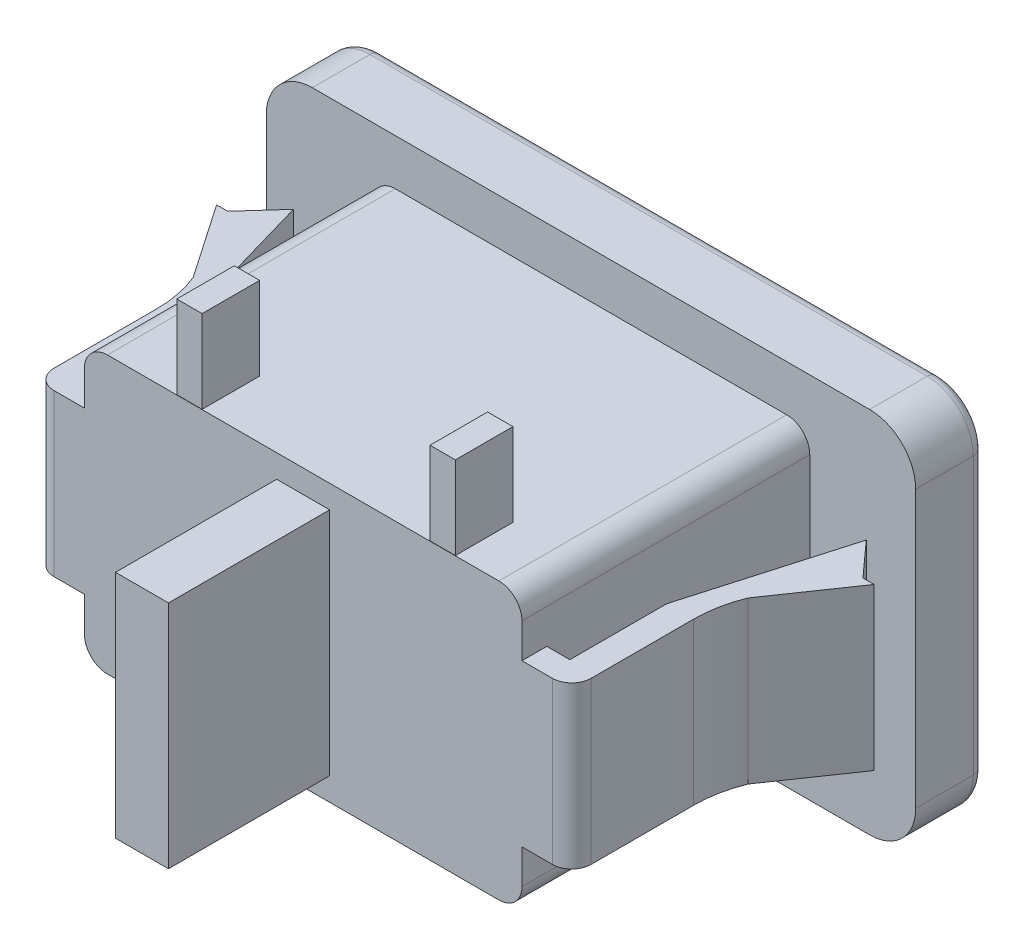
from build123d import *

# Parameters (mm, degrees)
BOSS_EXTRUDE1_DEPTH = 3
BOSS_EXTRUDE3_DEPTH = 12.5
BOSS_EXTRUDE7_DEPTH = 3.5
CUT_EXTRUDE1_DEPTH  = 13.6
SKETCH5_W           = 2.3
SKETCH5_H           = 10
BOSS_EXTRUDE4_DEPTH = 7
SKETCH7_R           = 3.15
BOSS_EXTRUDE6_DEPTH = 3.45
SKETCH6_R           = 1.18
BOSS_EXTRUDE5_DEPTH = 9.1
FILLET3_R           = 1.18
FILLET4_R           = 0.5
SKETCH14_W          = 1.1
SKETCH14_H          = 2.5
BOSS_EXTRUDE8_DEPTH = 3.6


with BuildPart() as part:
    # Sketch1 → Boss-Extrude1 (new body)
    with BuildSketch(Plane.XY):
        with BuildLine():
            Line((-12.1, -8), (12.1, -8))
            ThreePointArc((12.1, -8), (13.514213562, -7.414213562), (14.1, -6))
            Line((14.1, -6), (14.1, 6))
            ThreePointArc((14.1, 6), (13.514213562, 7.414213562), (12.1, 8))
            Line((12.1, 8), (-12.1, 8))
            ThreePointArc((-12.1, 8), (-13.514213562, 7.414213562), (-14.1, 6))
            Line((-14.1, 6), (-14.1, -6))
            ThreePointArc((-14.1, -6), (-13.514213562, -7.414213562), (-12.1, -8))
        make_face()
    extrude(amount=-BOSS_EXTRUDE1_DEPTH)

    # Sketch3 → Boss-Extrude3 (add)
    with BuildSketch(Plane.XY):
        with BuildLine():
            Line((-8.5, -6), (8.5, -6))
            ThreePointArc((8.5, -6), (9.207106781, -5.707106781), (9.5, -5))
            Line((9.5, -5), (9.5, 5))
            ThreePointArc((9.5, 5), (9.207106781, 5.707106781), (8.5, 6))
            Line((8.5, 6), (-8.5, 6))
            ThreePointArc((-8.5, 6), (-9.207106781, 5.707106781), (-9.5, 5))
            Line((-9.5, 5), (-9.5, -5))
            ThreePointArc((-9.5, -5), (-9.207106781, -5.707106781), (-8.5, -6))
        make_face()
    extrude(amount=BOSS_EXTRUDE3_DEPTH)

    # Sketch10 → Boss-Extrude7 (add, symmetric)
    with BuildSketch(Plane(origin=(0, 0, 0), x_dir=(1, 0, 0), z_dir=(0, 1, 0))):
        with BuildLine():
            Line((12.437506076, -0.483949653), (13.792565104, -1.984193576))
            Line((13.792565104, -1.984193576), (14.276514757, -1.984193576))
            Line((14.276514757, -1.984193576), (12.050346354, -5.22665625))
            ThreePointArc((12.050346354, -5.22665625), (11.760880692, -6.200043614), (11.663186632, -7.210849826))
            Line((11.663186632, -7.210849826), (11.663186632, -11.658617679))
            ThreePointArc((11.663186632, -11.658617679), (11.416751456, -12.253564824), (10.82180431, -12.5))
            Line((10.82180431, -12.5), (9.5, -12.5))
            Line((9.5, -12.5), (9.5, -11.421211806))
            Line((9.5, -11.421211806), (10.501707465, -11.421211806))
            Line((10.501707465, -11.421211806), (10.501707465, -7.210849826))
            Line((10.501707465, -7.210849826), (12.437506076, -0.483949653))
        make_face()
        with BuildLine():
            Line((-9.5, -12.5), (-9.5, -11.421211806))
            Line((-9.5, -11.421211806), (-10.501707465, -11.421211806))
            Line((-10.501707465, -11.421211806), (-10.501707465, -7.210849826))
            Line((-10.501707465, -7.210849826), (-12.437506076, -0.483949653))
            Line((-12.437506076, -0.483949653), (-13.792565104, -1.984193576))
            Line((-13.792565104, -1.984193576), (-14.276514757, -1.984193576))
            Line((-14.276514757, -1.984193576), (-12.050346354, -5.22665625))
            ThreePointArc((-12.050346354, -5.22665625), (-11.760880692, -6.200043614), (-11.663186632, -7.210849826))
            Line((-11.663186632, -7.210849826), (-11.663186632, -11.658617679))
            ThreePointArc((-11.663186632, -11.658617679), (-11.416751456, -12.253564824), (-10.82180431, -12.5))
            Line((-10.82180431, -12.5), (-9.5, -12.5))
        make_face()
    extrude(amount=BOSS_EXTRUDE7_DEPTH, both=True)

    # Sketch4 → Cut-Extrude1 (cut)
    with BuildSketch(Plane.XY.offset(-3)):
        with BuildLine():
            Line((-1.645448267, 3.85), (-0.866025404, 2.5))
            ThreePointArc((-0.866025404, 2.5), (0, 2), (0.866025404, 2.5))
            Line((0.866025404, 2.5), (1.645448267, 3.85))
            ThreePointArc((1.645448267, 3.85), (1.828460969, 4.033012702), (2.078460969, 4.1))
            Line((2.078460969, 4.1), (4.15, 4.1))
            ThreePointArc((4.15, 4.1), (8.25, 0), (4.15, -4.1))
            Line((4.15, -4.1), (2.078460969, -4.1))
            ThreePointArc((2.078460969, -4.1), (1.828460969, -4.033012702), (1.645448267, -3.85))
            Line((1.645448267, -3.85), (0.866025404, -2.5))
            ThreePointArc((0.866025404, -2.5), (0, -2), (-0.866025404, -2.5))
            Line((-0.866025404, -2.5), (-1.645448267, -3.85))
            ThreePointArc((-1.645448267, -3.85), (-1.828460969, -4.033012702), (-2.078460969, -4.1))
            Line((-2.078460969, -4.1), (-4.15, -4.1))
            ThreePointArc((-4.15, -4.1), (-8.25, 0), (-4.15, 4.1))
            Line((-4.15, 4.1), (-2.078460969, 4.1))
            ThreePointArc((-2.078460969, 4.1), (-1.828460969, 4.033012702), (-1.645448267, 3.85))
        make_face()
    extrude(amount=CUT_EXTRUDE1_DEPTH, mode=Mode.SUBTRACT)

    # Sketch5 → Boss-Extrude4 (add)
    with BuildSketch(Plane.XY.offset(12.5)):
        Rectangle(SKETCH5_W, SKETCH5_H)
    extrude(amount=BOSS_EXTRUDE4_DEPTH)

    # Sketch7 → Boss-Extrude6 (add)
    with BuildSketch(Plane(origin=(0, 0, 10.6), x_dir=(-1, 0, 0), z_dir=(0, 0, -1))):
        with Locations(Location((-4.3, 0, 0), (0, 0, 180))):
            Circle(SKETCH7_R)
        with Locations(Location((4.3, 0, 0), (0, 0, 180))):
            Circle(SKETCH7_R)
    extrude(amount=BOSS_EXTRUDE6_DEPTH)

    # Sketch6 → Boss-Extrude5 (add)
    with BuildSketch(Plane(origin=(0, 0, 7.15), x_dir=(-1, 0, 0), z_dir=(0, 0, -1))):
        with Locations((-4.3, 0)):
            Circle(SKETCH6_R)
        with Locations((4.3, 0)):
            Circle(SKETCH6_R)
    extrude(amount=BOSS_EXTRUDE5_DEPTH)

    # Fillet3
    fillet3_edges = [part.edges().sort_by_distance(p)[0] for p in [
        (5.48, 0, -1.95),
        (-3.12, 0, -1.95),
    ]]
    fillet(fillet3_edges, radius=FILLET3_R)

    # Fillet4
    fillet4_edges = [part.edges().sort_by_distance(p)[0] for p in [
        (-13.514213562, 7.414213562, -3),
        (-14.1, 0, -3),
        (-13.514213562, -7.414213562, -3),
        (0, -8, -3),
        (13.514213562, -7.414213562, -3),
        (14.1, 0, -3),
        (13.514213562, 7.414213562, -3),
        (0, 8, -3),
    ]]
    fillet(fillet4_edges, radius=FILLET4_R)

    # Sketch14 → Boss-Extrude8 (add)
    with BuildSketch(Plane(origin=(0, 6, 0), x_dir=(1, 0, 0), z_dir=(0, 1, 0))):
        with Locations((-4.95, -11.24)):
            Rectangle(SKETCH14_W, SKETCH14_H)
        with Locations((6.05, -11.24)):
            Rectangle(SKETCH14_W, SKETCH14_H)
    extrude(amount=BOSS_EXTRUDE8_DEPTH)


solid = part.part
